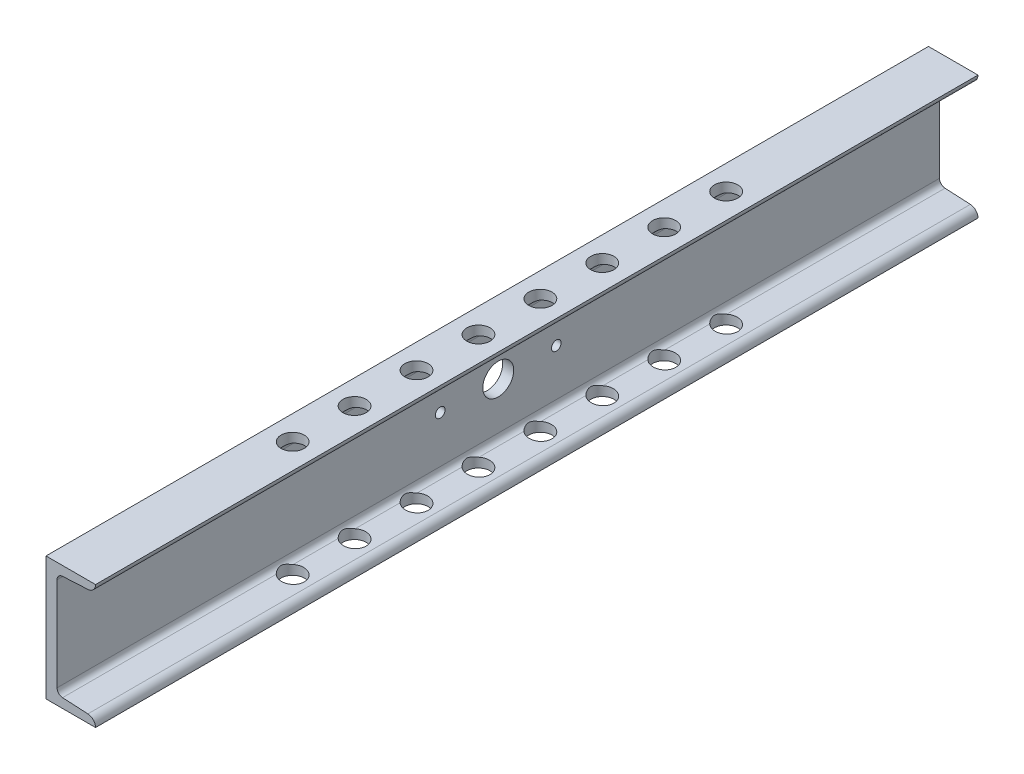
from build123d import *

# Parameters (mm, degrees)
BASE_EXTRUDE_DEPTH = 361.95
SKETCH2_R          = 9.525
CUT_EXTRUDE1_DEPTH = 379.129570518
SKETCH3_R          = 3.96875
SKETCH3_R_2        = 12.7
CUT_EXTRUDE2_DEPTH = 368.749985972


with BuildPart() as part:
    # Sketch1 → Base-Extrude (new, symmetric)
    with BuildSketch(Plane.XY):
        with BuildLine():
            Line((40.64, 50.8), (0, 50.8))
            Line((0, 50.8), (0, -50.8))
            Line((0, -50.8), (40.64, -50.8))
            ThreePointArc((40.64, -50.8), (38.826373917, -46.25411032), (34.381632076, -44.205056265))
            Line((34.381632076, -44.205056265), (13.555650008, -43.113612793))
            ThreePointArc((13.555650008, -43.113612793), (10.350304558, -41.635928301), (9.0424, -38.357639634))
            Line((9.0424, -38.357639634), (9.0424, 38.357639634))
            ThreePointArc((9.0424, 38.357639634), (10.350304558, 41.635928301), (13.555650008, 43.113612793))
            Line((13.555650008, 43.113612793), (34.381632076, 44.205056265))
            ThreePointArc((34.381632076, 44.205056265), (38.826373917, 46.25411032), (40.64, 50.8))
        make_face()
    extrude(amount=BASE_EXTRUDE_DEPTH, both=True)

    # Sketch2 → Cut-Extrude1 (cut, through all)
    with BuildSketch(Plane(origin=(0, 50.8, 0), x_dir=(-1, 0, 0), z_dir=(0, 1, 0))):
        with Locations(Location((-20.066, 27.278574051, 0), (0, 0, 90))):
            Circle(SKETCH2_R)
        with Locations(Location((-20.066, 78.078574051, 0), (0, 0, 90))):
            Circle(SKETCH2_R)
        with Locations(Location((-20.066, 128.878574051, 0), (0, 0, 90))):
            Circle(SKETCH2_R)
        with Locations(Location((-20.066, 179.678574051, 0), (0, 0, 90))):
            Circle(SKETCH2_R)
        with Locations(Location((-20.066, -175.921425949, 0), (0, 0, 46.882142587))):
            Circle(SKETCH2_R)
        with Locations(Location((-20.066, -125.121425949, 0), (0, 0, 46.882142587))):
            Circle(SKETCH2_R)
        with Locations(Location((-20.066, -74.321425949, 0), (0, 0, 46.882142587))):
            Circle(SKETCH2_R)
        with Locations(Location((-20.066, -23.521425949, 0), (0, 0, 46.882142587))):
            Circle(SKETCH2_R)
    extrude(amount=-CUT_EXTRUDE1_DEPTH, mode=Mode.SUBTRACT)

    # Sketch3 → Cut-Extrude2 (cut, through all)
    with BuildSketch(Plane.ZY):
        with Locations((-47.625, 0)):
            Circle(SKETCH3_R)
        with Locations(Location((47.625, 0, 0), (0, 0, 270))):
            Circle(SKETCH3_R)
        Circle(SKETCH3_R_2)
    extrude(amount=-CUT_EXTRUDE2_DEPTH, mode=Mode.SUBTRACT)


solid = part.part
